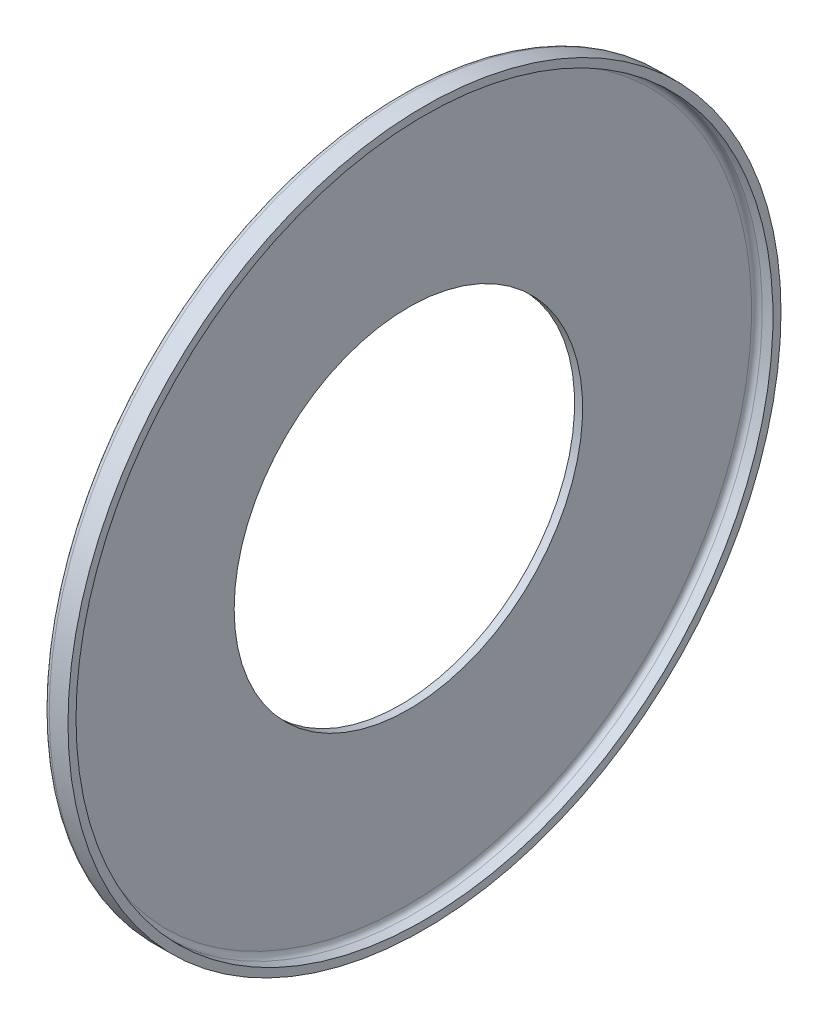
from build123d import *


with BuildPart() as part:
    # Esquisse1 → Base-R_volution (revolve)
    with BuildSketch(Plane.XY, mode=Mode.PRIVATE) as base_r_volution_sk:
        with BuildLine():
            Line((-30, 65.5), (-30, 32.5))
            Line((-30, 32.5), (-28.5, 32.5))
            Line((-28.5, 32.5), (-28.5, 64))
            ThreePointArc((-28.5, 64), (-28.207106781, 64.707106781), (-27.5, 65))
            Line((-27.5, 65), (-25.5, 65))
            Line((-25.5, 65), (-25.5, 66.5))
            Line((-25.5, 66.5), (-29, 66.5))
            ThreePointArc((-29, 66.5), (-29.707106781, 66.207106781), (-30, 65.5))
        make_face()
    revolve(base_r_volution_sk.sketch.rotate(Axis((-100, 0, 0), (1, 0, 0)), 90), axis=Axis((-100, 0, 0), (1, 0, 0)))


solid = part.part
